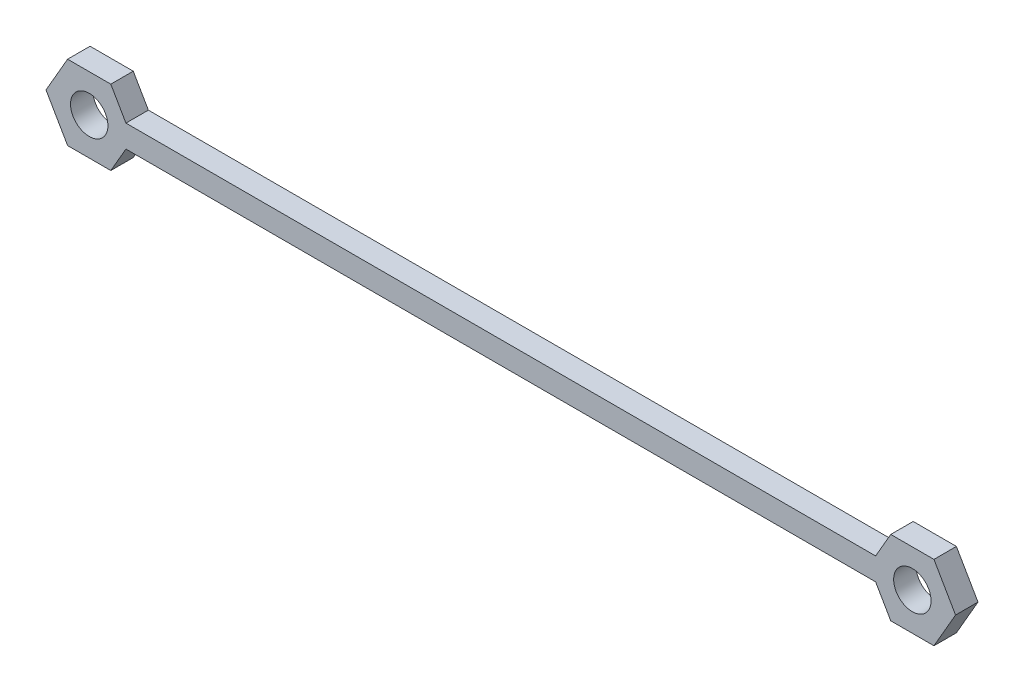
ISO-10303-21;
HEADER;
FILE_DESCRIPTION(('STEP AP214'),'2;1');
FILE_NAME('part.step','',(''),(''),'','','');
FILE_SCHEMA(('AUTOMOTIVE_DESIGN { 1 0 10303 214 1 1 1 1 }'));
ENDSEC;
DATA;
#1=APPLICATION_CONTEXT('core data for automotive mechanical design processes');
#2=APPLICATION_PROTOCOL_DEFINITION('international standard','automotive_design',2000,#1);
#3=PRODUCT_CONTEXT('',#1,'mechanical');
#4=PRODUCT('Part','Part','',(#3));
#5=PRODUCT_RELATED_PRODUCT_CATEGORY('part','',(#4));
#6=PRODUCT_DEFINITION_FORMATION('','',#4);
#7=PRODUCT_DEFINITION_CONTEXT('part definition',#1,'design');
#8=PRODUCT_DEFINITION('design','',#6,#7);
#9=PRODUCT_DEFINITION_SHAPE('','',#8);
#10=(LENGTH_UNIT() NAMED_UNIT(*) SI_UNIT(.MILLI.,.METRE.));
#11=(NAMED_UNIT(*) PLANE_ANGLE_UNIT() SI_UNIT($,.RADIAN.));
#12=(NAMED_UNIT(*) SI_UNIT($,.STERADIAN.) SOLID_ANGLE_UNIT());
#13=UNCERTAINTY_MEASURE_WITH_UNIT(LENGTH_MEASURE(1.E-05),#10,'distance_accuracy_value','');
#14=(GEOMETRIC_REPRESENTATION_CONTEXT(3) GLOBAL_UNCERTAINTY_ASSIGNED_CONTEXT((#13)) GLOBAL_UNIT_ASSIGNED_CONTEXT((#10,
#11,#12)) REPRESENTATION_CONTEXT('',''));
#15=CARTESIAN_POINT('',(0.,0.,0.));
#16=DIRECTION('',(0.,0.,1.));
#17=DIRECTION('',(1.,0.,0.));
#18=AXIS2_PLACEMENT_3D('',#15,#16,#17);
#19=CARTESIAN_POINT('',(0.,0.,1.5));
#20=DIRECTION('',(0.,0.,1.));
#21=DIRECTION('',(1.,0.,0.));
#22=AXIS2_PLACEMENT_3D('',#19,#20,#21);
#23=PLANE('',#22);
#24=CARTESIAN_POINT('',(-55.,0.,1.5));
#25=DIRECTION('',(0.,0.,1.));
#26=DIRECTION('',(1.,0.,0.));
#27=AXIS2_PLACEMENT_3D('',#24,#25,#26);
#28=CIRCLE('',#27,2.5);
#29=CARTESIAN_POINT('',(-52.5,0.,1.5));
#30=VERTEX_POINT('',#29);
#31=EDGE_CURVE('E175',#30,#30,#28,.T.);
#32=ORIENTED_EDGE('',*,*,#31,.F.);
#33=EDGE_LOOP('',(#32));
#34=FACE_BOUND('',#33,.T.);
#35=DIRECTION('',(-0.500000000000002,0.866025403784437,0.));
#36=VECTOR('',#35,1.);
#37=CARTESIAN_POINT('',(-52.1132486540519,5.,1.5));
#38=LINE('',#37,#36);
#39=CARTESIAN_POINT('',(-50.0925227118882,1.5,1.5));
#40=VERTEX_POINT('',#39);
#41=CARTESIAN_POINT('',(-52.1132486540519,5.,1.5));
#42=VERTEX_POINT('',#41);
#43=EDGE_CURVE('E198',#40,#42,#38,.T.);
#44=ORIENTED_EDGE('',*,*,#43,.T.);
#45=DIRECTION('',(-1.,0.,0.));
#46=VECTOR('',#45,1.);
#47=CARTESIAN_POINT('',(-52.1132486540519,5.,1.5));
#48=LINE('',#47,#46);
#49=CARTESIAN_POINT('',(-57.8867513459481,4.99999999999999,1.5));
#50=VERTEX_POINT('',#49);
#51=EDGE_CURVE('E116',#42,#50,#48,.T.);
#52=ORIENTED_EDGE('',*,*,#51,.T.);
#53=DIRECTION('',(-0.499999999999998,-0.866025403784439,0.));
#54=VECTOR('',#53,1.);
#55=CARTESIAN_POINT('',(-57.8867513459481,4.99999999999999,1.5));
#56=LINE('',#55,#54);
#57=CARTESIAN_POINT('',(-60.7735026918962,0.,1.5));
#58=VERTEX_POINT('',#57);
#59=EDGE_CURVE('E231',#50,#58,#56,.T.);
#60=ORIENTED_EDGE('',*,*,#59,.T.);
#61=DIRECTION('',(0.500000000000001,-0.866025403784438,0.));
#62=VECTOR('',#61,1.);
#63=CARTESIAN_POINT('',(-60.7735026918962,0.,1.5));
#64=LINE('',#63,#62);
#65=CARTESIAN_POINT('',(-57.8867513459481,-5.,1.5));
#66=VERTEX_POINT('',#65);
#67=EDGE_CURVE('E250',#58,#66,#64,.T.);
#68=ORIENTED_EDGE('',*,*,#67,.T.);
#69=DIRECTION('',(1.,0.,0.));
#70=VECTOR('',#69,1.);
#71=CARTESIAN_POINT('',(-57.8867513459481,-5.,1.5));
#72=LINE('',#71,#70);
#73=CARTESIAN_POINT('',(-52.1132486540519,-4.99999999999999,1.5));
#74=VERTEX_POINT('',#73);
#75=EDGE_CURVE('E247',#66,#74,#72,.T.);
#76=ORIENTED_EDGE('',*,*,#75,.T.);
#77=DIRECTION('',(0.499999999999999,0.866025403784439,0.));
#78=VECTOR('',#77,1.);
#79=CARTESIAN_POINT('',(-50.0925227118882,-1.5,1.5));
#80=LINE('',#79,#78);
#81=CARTESIAN_POINT('',(-50.0925227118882,-1.5,1.5));
#82=VERTEX_POINT('',#81);
#83=EDGE_CURVE('E249',#74,#82,#80,.T.);
#84=ORIENTED_EDGE('',*,*,#83,.T.);
#85=DIRECTION('',(1.,0.,0.));
#86=VECTOR('',#85,1.);
#87=CARTESIAN_POINT('',(-50.0925227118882,-1.5,1.5));
#88=LINE('',#87,#86);
#89=CARTESIAN_POINT('',(50.0925227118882,-1.5,1.5));
#90=VERTEX_POINT('',#89);
#91=EDGE_CURVE('E252',#82,#90,#88,.T.);
#92=ORIENTED_EDGE('',*,*,#91,.T.);
#93=DIRECTION('',(0.499999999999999,-0.866025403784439,0.));
#94=VECTOR('',#93,1.);
#95=CARTESIAN_POINT('',(50.0925227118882,-1.5,1.5));
#96=LINE('',#95,#94);
#97=CARTESIAN_POINT('',(52.1132486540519,-4.99999999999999,1.5));
#98=VERTEX_POINT('',#97);
#99=EDGE_CURVE('E258',#90,#98,#96,.T.);
#100=ORIENTED_EDGE('',*,*,#99,.T.);
#101=DIRECTION('',(1.,0.,0.));
#102=VECTOR('',#101,1.);
#103=CARTESIAN_POINT('',(57.8867513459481,-5.,1.5));
#104=LINE('',#103,#102);
#105=CARTESIAN_POINT('',(57.8867513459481,-5.,1.5));
#106=VERTEX_POINT('',#105);
#107=EDGE_CURVE('E260',#98,#106,#104,.T.);
#108=ORIENTED_EDGE('',*,*,#107,.T.);
#109=DIRECTION('',(0.500000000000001,0.866025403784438,0.));
#110=VECTOR('',#109,1.);
#111=CARTESIAN_POINT('',(60.7735026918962,0.,1.5));
#112=LINE('',#111,#110);
#113=CARTESIAN_POINT('',(60.7735026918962,0.,1.5));
#114=VERTEX_POINT('',#113);
#115=EDGE_CURVE('E262',#106,#114,#112,.T.);
#116=ORIENTED_EDGE('',*,*,#115,.T.);
#117=DIRECTION('',(-0.499999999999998,0.866025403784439,0.));
#118=VECTOR('',#117,1.);
#119=CARTESIAN_POINT('',(57.8867513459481,4.99999999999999,1.5));
#120=LINE('',#119,#118);
#121=CARTESIAN_POINT('',(57.8867513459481,4.99999999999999,1.5));
#122=VERTEX_POINT('',#121);
#123=EDGE_CURVE('E153',#114,#122,#120,.T.);
#124=ORIENTED_EDGE('',*,*,#123,.T.);
#125=DIRECTION('',(-1.,0.,0.));
#126=VECTOR('',#125,1.);
#127=CARTESIAN_POINT('',(52.1132486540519,5.,1.5));
#128=LINE('',#127,#126);
#129=CARTESIAN_POINT('',(52.1132486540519,5.,1.5));
#130=VERTEX_POINT('',#129);
#131=EDGE_CURVE('E147',#122,#130,#128,.T.);
#132=ORIENTED_EDGE('',*,*,#131,.T.);
#133=DIRECTION('',(-0.500000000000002,-0.866025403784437,0.));
#134=VECTOR('',#133,1.);
#135=CARTESIAN_POINT('',(52.1132486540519,5.,1.5));
#136=LINE('',#135,#134);
#137=CARTESIAN_POINT('',(50.0925227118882,1.5,1.5));
#138=VERTEX_POINT('',#137);
#139=EDGE_CURVE('E151',#130,#138,#136,.T.);
#140=ORIENTED_EDGE('',*,*,#139,.T.);
#141=DIRECTION('',(-1.,0.,0.));
#142=VECTOR('',#141,1.);
#143=CARTESIAN_POINT('',(-50.0925227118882,1.5,1.5));
#144=LINE('',#143,#142);
#145=EDGE_CURVE('E55',#138,#40,#144,.T.);
#146=ORIENTED_EDGE('',*,*,#145,.T.);
#147=EDGE_LOOP('',(#44,#52,#60,#68,#76,#84,#92,#100,#108,#116,#124,#132,#140,#146));
#148=FACE_BOUND('',#147,.T.);
#149=CARTESIAN_POINT('',(55.,0.,1.5));
#150=DIRECTION('',(0.,0.,1.));
#151=DIRECTION('',(1.,0.,0.));
#152=AXIS2_PLACEMENT_3D('',#149,#150,#151);
#153=CIRCLE('',#152,2.5);
#154=CARTESIAN_POINT('',(57.5,0.,1.5));
#155=VERTEX_POINT('',#154);
#156=EDGE_CURVE('E304',#155,#155,#153,.T.);
#157=ORIENTED_EDGE('',*,*,#156,.F.);
#158=EDGE_LOOP('',(#157));
#159=FACE_BOUND('',#158,.T.);
#160=ADVANCED_FACE('F38',(#34,#148,#159),#23,.T.);
#161=CARTESIAN_POINT('',(0.,0.,-1.5));
#162=DIRECTION('',(0.,0.,1.));
#163=DIRECTION('',(1.,0.,0.));
#164=AXIS2_PLACEMENT_3D('',#161,#162,#163);
#165=PLANE('',#164);
#166=DIRECTION('',(-0.500000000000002,0.866025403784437,0.));
#167=VECTOR('',#166,1.);
#168=CARTESIAN_POINT('',(-52.1132486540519,5.,-1.5));
#169=LINE('',#168,#167);
#170=CARTESIAN_POINT('',(-50.0925227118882,1.5,-1.5));
#171=VERTEX_POINT('',#170);
#172=CARTESIAN_POINT('',(-52.1132486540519,5.,-1.5));
#173=VERTEX_POINT('',#172);
#174=EDGE_CURVE('E171',#171,#173,#169,.T.);
#175=ORIENTED_EDGE('',*,*,#174,.F.);
#176=DIRECTION('',(-1.,0.,0.));
#177=VECTOR('',#176,1.);
#178=CARTESIAN_POINT('',(-50.0925227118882,1.5,-1.5));
#179=LINE('',#178,#177);
#180=CARTESIAN_POINT('',(50.0925227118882,1.5,-1.5));
#181=VERTEX_POINT('',#180);
#182=EDGE_CURVE('E108',#181,#171,#179,.T.);
#183=ORIENTED_EDGE('',*,*,#182,.F.);
#184=DIRECTION('',(-0.500000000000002,-0.866025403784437,0.));
#185=VECTOR('',#184,1.);
#186=CARTESIAN_POINT('',(52.1132486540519,5.,-1.5));
#187=LINE('',#186,#185);
#188=CARTESIAN_POINT('',(52.1132486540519,5.,-1.5));
#189=VERTEX_POINT('',#188);
#190=EDGE_CURVE('E102',#189,#181,#187,.T.);
#191=ORIENTED_EDGE('',*,*,#190,.F.);
#192=DIRECTION('',(-1.,0.,0.));
#193=VECTOR('',#192,1.);
#194=CARTESIAN_POINT('',(52.1132486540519,5.,-1.5));
#195=LINE('',#194,#193);
#196=CARTESIAN_POINT('',(57.8867513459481,4.99999999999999,-1.5));
#197=VERTEX_POINT('',#196);
#198=EDGE_CURVE('E161',#197,#189,#195,.T.);
#199=ORIENTED_EDGE('',*,*,#198,.F.);
#200=DIRECTION('',(-0.499999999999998,0.866025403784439,0.));
#201=VECTOR('',#200,1.);
#202=CARTESIAN_POINT('',(57.8867513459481,4.99999999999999,-1.5));
#203=LINE('',#202,#201);
#204=CARTESIAN_POINT('',(60.7735026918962,0.,-1.5));
#205=VERTEX_POINT('',#204);
#206=EDGE_CURVE('E193',#205,#197,#203,.T.);
#207=ORIENTED_EDGE('',*,*,#206,.F.);
#208=DIRECTION('',(0.500000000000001,0.866025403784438,0.));
#209=VECTOR('',#208,1.);
#210=CARTESIAN_POINT('',(60.7735026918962,0.,-1.5));
#211=LINE('',#210,#209);
#212=CARTESIAN_POINT('',(57.8867513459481,-5.,-1.5));
#213=VERTEX_POINT('',#212);
#214=EDGE_CURVE('E191',#213,#205,#211,.T.);
#215=ORIENTED_EDGE('',*,*,#214,.F.);
#216=DIRECTION('',(1.,0.,0.));
#217=VECTOR('',#216,1.);
#218=CARTESIAN_POINT('',(57.8867513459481,-5.,-1.5));
#219=LINE('',#218,#217);
#220=CARTESIAN_POINT('',(52.1132486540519,-4.99999999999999,-1.5));
#221=VERTEX_POINT('',#220);
#222=EDGE_CURVE('E189',#221,#213,#219,.T.);
#223=ORIENTED_EDGE('',*,*,#222,.F.);
#224=DIRECTION('',(0.499999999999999,-0.866025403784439,0.));
#225=VECTOR('',#224,1.);
#226=CARTESIAN_POINT('',(50.0925227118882,-1.5,-1.5));
#227=LINE('',#226,#225);
#228=CARTESIAN_POINT('',(50.0925227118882,-1.5,-1.5));
#229=VERTEX_POINT('',#228);
#230=EDGE_CURVE('E187',#229,#221,#227,.T.);
#231=ORIENTED_EDGE('',*,*,#230,.F.);
#232=DIRECTION('',(1.,0.,0.));
#233=VECTOR('',#232,1.);
#234=CARTESIAN_POINT('',(-50.0925227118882,-1.5,-1.5));
#235=LINE('',#234,#233);
#236=CARTESIAN_POINT('',(-50.0925227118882,-1.5,-1.5));
#237=VERTEX_POINT('',#236);
#238=EDGE_CURVE('E185',#237,#229,#235,.T.);
#239=ORIENTED_EDGE('',*,*,#238,.F.);
#240=DIRECTION('',(0.499999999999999,0.866025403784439,0.));
#241=VECTOR('',#240,1.);
#242=CARTESIAN_POINT('',(-50.0925227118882,-1.5,-1.5));
#243=LINE('',#242,#241);
#244=CARTESIAN_POINT('',(-52.1132486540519,-4.99999999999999,-1.5));
#245=VERTEX_POINT('',#244);
#246=EDGE_CURVE('E183',#245,#237,#243,.T.);
#247=ORIENTED_EDGE('',*,*,#246,.F.);
#248=DIRECTION('',(1.,0.,0.));
#249=VECTOR('',#248,1.);
#250=CARTESIAN_POINT('',(-57.8867513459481,-5.,-1.5));
#251=LINE('',#250,#249);
#252=CARTESIAN_POINT('',(-57.8867513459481,-5.,-1.5));
#253=VERTEX_POINT('',#252);
#254=EDGE_CURVE('E181',#253,#245,#251,.T.);
#255=ORIENTED_EDGE('',*,*,#254,.F.);
#256=DIRECTION('',(0.500000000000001,-0.866025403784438,0.));
#257=VECTOR('',#256,1.);
#258=CARTESIAN_POINT('',(-60.7735026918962,0.,-1.5));
#259=LINE('',#258,#257);
#260=CARTESIAN_POINT('',(-60.7735026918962,0.,-1.5));
#261=VERTEX_POINT('',#260);
#262=EDGE_CURVE('E179',#261,#253,#259,.T.);
#263=ORIENTED_EDGE('',*,*,#262,.F.);
#264=DIRECTION('',(-0.499999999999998,-0.866025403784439,0.));
#265=VECTOR('',#264,1.);
#266=CARTESIAN_POINT('',(-57.8867513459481,4.99999999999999,-1.5));
#267=LINE('',#266,#265);
#268=CARTESIAN_POINT('',(-57.8867513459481,4.99999999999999,-1.5));
#269=VERTEX_POINT('',#268);
#270=EDGE_CURVE('E177',#269,#261,#267,.T.);
#271=ORIENTED_EDGE('',*,*,#270,.F.);
#272=DIRECTION('',(-1.,0.,0.));
#273=VECTOR('',#272,1.);
#274=CARTESIAN_POINT('',(-52.1132486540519,5.,-1.5));
#275=LINE('',#274,#273);
#276=EDGE_CURVE('E174',#173,#269,#275,.T.);
#277=ORIENTED_EDGE('',*,*,#276,.F.);
#278=EDGE_LOOP('',(#175,#183,#191,#199,#207,#215,#223,#231,#239,#247,#255,#263,#271,#277));
#279=FACE_BOUND('',#278,.T.);
#280=CARTESIAN_POINT('',(-55.,0.,-1.5));
#281=DIRECTION('',(0.,0.,1.));
#282=DIRECTION('',(1.,0.,0.));
#283=AXIS2_PLACEMENT_3D('',#280,#281,#282);
#284=CIRCLE('',#283,2.5);
#285=CARTESIAN_POINT('',(-52.5,0.,-1.5));
#286=VERTEX_POINT('',#285);
#287=EDGE_CURVE('E310',#286,#286,#284,.T.);
#288=ORIENTED_EDGE('',*,*,#287,.T.);
#289=EDGE_LOOP('',(#288));
#290=FACE_BOUND('',#289,.T.);
#291=CARTESIAN_POINT('',(55.,0.,-1.5));
#292=DIRECTION('',(0.,0.,1.));
#293=DIRECTION('',(1.,0.,0.));
#294=AXIS2_PLACEMENT_3D('',#291,#292,#293);
#295=CIRCLE('',#294,2.5);
#296=CARTESIAN_POINT('',(57.5,0.,-1.5));
#297=VERTEX_POINT('',#296);
#298=EDGE_CURVE('E307',#297,#297,#295,.T.);
#299=ORIENTED_EDGE('',*,*,#298,.T.);
#300=EDGE_LOOP('',(#299));
#301=FACE_BOUND('',#300,.T.);
#302=ADVANCED_FACE('F235',(#279,#290,#301),#165,.F.);
#303=CARTESIAN_POINT('',(-52.1132486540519,5.,1.5));
#304=DIRECTION('',(-0.866025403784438,-0.500000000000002,0.));
#305=DIRECTION('',(0.500000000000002,-0.866025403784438,0.));
#306=AXIS2_PLACEMENT_3D('',#303,#304,#305);
#307=PLANE('',#306);
#308=ORIENTED_EDGE('',*,*,#174,.T.);
#309=DIRECTION('',(0.,0.,-1.));
#310=VECTOR('',#309,1.);
#311=CARTESIAN_POINT('',(-52.1132486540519,5.,1.5));
#312=LINE('',#311,#310);
#313=EDGE_CURVE('E11',#42,#173,#312,.T.);
#314=ORIENTED_EDGE('',*,*,#313,.F.);
#315=ORIENTED_EDGE('',*,*,#43,.F.);
#316=DIRECTION('',(0.,0.,-1.));
#317=VECTOR('',#316,1.);
#318=CARTESIAN_POINT('',(-50.0925227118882,1.5,1.5));
#319=LINE('',#318,#317);
#320=EDGE_CURVE('E167',#40,#171,#319,.T.);
#321=ORIENTED_EDGE('',*,*,#320,.T.);
#322=EDGE_LOOP('',(#308,#314,#315,#321));
#323=FACE_BOUND('',#322,.T.);
#324=ADVANCED_FACE('F40',(#323),#307,.F.);
#325=CARTESIAN_POINT('',(-52.1132486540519,5.,1.5));
#326=DIRECTION('',(0.,-1.,0.));
#327=DIRECTION('',(1.,0.,0.));
#328=AXIS2_PLACEMENT_3D('',#325,#326,#327);
#329=PLANE('',#328);
#330=ORIENTED_EDGE('',*,*,#276,.T.);
#331=DIRECTION('',(0.,0.,-1.));
#332=VECTOR('',#331,1.);
#333=CARTESIAN_POINT('',(-57.8867513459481,4.99999999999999,1.5));
#334=LINE('',#333,#332);
#335=EDGE_CURVE('E47',#50,#269,#334,.T.);
#336=ORIENTED_EDGE('',*,*,#335,.F.);
#337=ORIENTED_EDGE('',*,*,#51,.F.);
#338=ORIENTED_EDGE('',*,*,#313,.T.);
#339=EDGE_LOOP('',(#330,#336,#337,#338));
#340=FACE_BOUND('',#339,.T.);
#341=ADVANCED_FACE('F435',(#340),#329,.F.);
#342=CARTESIAN_POINT('',(-57.8867513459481,4.99999999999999,1.5));
#343=DIRECTION('',(0.86602540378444,-0.499999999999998,0.));
#344=DIRECTION('',(0.499999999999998,0.86602540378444,0.));
#345=AXIS2_PLACEMENT_3D('',#342,#343,#344);
#346=PLANE('',#345);
#347=ORIENTED_EDGE('',*,*,#270,.T.);
#348=DIRECTION('',(0.,0.,-1.));
#349=VECTOR('',#348,1.);
#350=CARTESIAN_POINT('',(-60.7735026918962,0.,1.5));
#351=LINE('',#350,#349);
#352=EDGE_CURVE('E223',#58,#261,#351,.T.);
#353=ORIENTED_EDGE('',*,*,#352,.F.);
#354=ORIENTED_EDGE('',*,*,#59,.F.);
#355=ORIENTED_EDGE('',*,*,#335,.T.);
#356=EDGE_LOOP('',(#347,#353,#354,#355));
#357=FACE_BOUND('',#356,.T.);
#358=ADVANCED_FACE('F229',(#357),#346,.F.);
#359=CARTESIAN_POINT('',(-60.7735026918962,0.,1.5));
#360=DIRECTION('',(0.866025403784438,0.500000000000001,0.));
#361=DIRECTION('',(-0.500000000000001,0.866025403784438,0.));
#362=AXIS2_PLACEMENT_3D('',#359,#360,#361);
#363=PLANE('',#362);
#364=ORIENTED_EDGE('',*,*,#262,.T.);
#365=DIRECTION('',(0.,0.,-1.));
#366=VECTOR('',#365,1.);
#367=CARTESIAN_POINT('',(-57.8867513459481,-5.,1.5));
#368=LINE('',#367,#366);
#369=EDGE_CURVE('E220',#66,#253,#368,.T.);
#370=ORIENTED_EDGE('',*,*,#369,.F.);
#371=ORIENTED_EDGE('',*,*,#67,.F.);
#372=ORIENTED_EDGE('',*,*,#352,.T.);
#373=EDGE_LOOP('',(#364,#370,#371,#372));
#374=FACE_BOUND('',#373,.T.);
#375=ADVANCED_FACE('F241',(#374),#363,.F.);
#376=CARTESIAN_POINT('',(-57.8867513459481,-5.,1.5));
#377=DIRECTION('',(0.,1.,0.));
#378=DIRECTION('',(-1.,0.,0.));
#379=AXIS2_PLACEMENT_3D('',#376,#377,#378);
#380=PLANE('',#379);
#381=ORIENTED_EDGE('',*,*,#254,.T.);
#382=DIRECTION('',(0.,0.,-1.));
#383=VECTOR('',#382,1.);
#384=CARTESIAN_POINT('',(-52.1132486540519,-4.99999999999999,1.5));
#385=LINE('',#384,#383);
#386=EDGE_CURVE('E217',#74,#245,#385,.T.);
#387=ORIENTED_EDGE('',*,*,#386,.F.);
#388=ORIENTED_EDGE('',*,*,#75,.F.);
#389=ORIENTED_EDGE('',*,*,#369,.T.);
#390=EDGE_LOOP('',(#381,#387,#388,#389));
#391=FACE_BOUND('',#390,.T.);
#392=ADVANCED_FACE('F245',(#391),#380,.F.);
#393=CARTESIAN_POINT('',(-50.0925227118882,-1.5,1.5));
#394=DIRECTION('',(-0.866025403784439,0.499999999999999,0.));
#395=DIRECTION('',(-0.499999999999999,-0.866025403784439,0.));
#396=AXIS2_PLACEMENT_3D('',#393,#394,#395);
#397=PLANE('',#396);
#398=ORIENTED_EDGE('',*,*,#246,.T.);
#399=DIRECTION('',(0.,0.,-1.));
#400=VECTOR('',#399,1.);
#401=CARTESIAN_POINT('',(-50.0925227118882,-1.5,1.5));
#402=LINE('',#401,#400);
#403=EDGE_CURVE('E214',#82,#237,#402,.T.);
#404=ORIENTED_EDGE('',*,*,#403,.F.);
#405=ORIENTED_EDGE('',*,*,#83,.F.);
#406=ORIENTED_EDGE('',*,*,#386,.T.);
#407=EDGE_LOOP('',(#398,#404,#405,#406));
#408=FACE_BOUND('',#407,.T.);
#409=ADVANCED_FACE('F396',(#408),#397,.F.);
#410=CARTESIAN_POINT('',(-50.0925227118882,-1.5,1.5));
#411=DIRECTION('',(0.,1.,0.));
#412=DIRECTION('',(0.,0.,1.));
#413=AXIS2_PLACEMENT_3D('',#410,#411,#412);
#414=PLANE('',#413);
#415=ORIENTED_EDGE('',*,*,#238,.T.);
#416=DIRECTION('',(0.,0.,-1.));
#417=VECTOR('',#416,1.);
#418=CARTESIAN_POINT('',(50.0925227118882,-1.5,1.5));
#419=LINE('',#418,#417);
#420=EDGE_CURVE('E211',#90,#229,#419,.T.);
#421=ORIENTED_EDGE('',*,*,#420,.F.);
#422=ORIENTED_EDGE('',*,*,#91,.F.);
#423=ORIENTED_EDGE('',*,*,#403,.T.);
#424=EDGE_LOOP('',(#415,#421,#422,#423));
#425=FACE_BOUND('',#424,.T.);
#426=ADVANCED_FACE('F385',(#425),#414,.F.);
#427=CARTESIAN_POINT('',(50.0925227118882,-1.5,1.5));
#428=DIRECTION('',(0.866025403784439,0.499999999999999,0.));
#429=DIRECTION('',(-0.499999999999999,0.866025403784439,0.));
#430=AXIS2_PLACEMENT_3D('',#427,#428,#429);
#431=PLANE('',#430);
#432=ORIENTED_EDGE('',*,*,#230,.T.);
#433=DIRECTION('',(0.,0.,-1.));
#434=VECTOR('',#433,1.);
#435=CARTESIAN_POINT('',(52.1132486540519,-4.99999999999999,1.5));
#436=LINE('',#435,#434);
#437=EDGE_CURVE('E208',#98,#221,#436,.T.);
#438=ORIENTED_EDGE('',*,*,#437,.F.);
#439=ORIENTED_EDGE('',*,*,#99,.F.);
#440=ORIENTED_EDGE('',*,*,#420,.T.);
#441=EDGE_LOOP('',(#432,#438,#439,#440));
#442=FACE_BOUND('',#441,.T.);
#443=ADVANCED_FACE('F374',(#442),#431,.F.);
#444=CARTESIAN_POINT('',(57.8867513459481,-5.,1.5));
#445=DIRECTION('',(0.,1.,0.));
#446=DIRECTION('',(-1.,0.,0.));
#447=AXIS2_PLACEMENT_3D('',#444,#445,#446);
#448=PLANE('',#447);
#449=ORIENTED_EDGE('',*,*,#222,.T.);
#450=DIRECTION('',(0.,0.,-1.));
#451=VECTOR('',#450,1.);
#452=CARTESIAN_POINT('',(57.8867513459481,-5.,1.5));
#453=LINE('',#452,#451);
#454=EDGE_CURVE('E205',#106,#213,#453,.T.);
#455=ORIENTED_EDGE('',*,*,#454,.F.);
#456=ORIENTED_EDGE('',*,*,#107,.F.);
#457=ORIENTED_EDGE('',*,*,#437,.T.);
#458=EDGE_LOOP('',(#449,#455,#456,#457));
#459=FACE_BOUND('',#458,.T.);
#460=ADVANCED_FACE('F364',(#459),#448,.F.);
#461=CARTESIAN_POINT('',(60.7735026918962,0.,1.5));
#462=DIRECTION('',(-0.866025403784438,0.500000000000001,0.));
#463=DIRECTION('',(-0.500000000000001,-0.866025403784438,0.));
#464=AXIS2_PLACEMENT_3D('',#461,#462,#463);
#465=PLANE('',#464);
#466=ORIENTED_EDGE('',*,*,#214,.T.);
#467=DIRECTION('',(0.,0.,-1.));
#468=VECTOR('',#467,1.);
#469=CARTESIAN_POINT('',(60.7735026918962,0.,1.5));
#470=LINE('',#469,#468);
#471=EDGE_CURVE('E202',#114,#205,#470,.T.);
#472=ORIENTED_EDGE('',*,*,#471,.F.);
#473=ORIENTED_EDGE('',*,*,#115,.F.);
#474=ORIENTED_EDGE('',*,*,#454,.T.);
#475=EDGE_LOOP('',(#466,#472,#473,#474));
#476=FACE_BOUND('',#475,.T.);
#477=ADVANCED_FACE('F268',(#476),#465,.F.);
#478=CARTESIAN_POINT('',(57.8867513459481,4.99999999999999,1.5));
#479=DIRECTION('',(-0.86602540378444,-0.499999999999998,0.));
#480=DIRECTION('',(0.499999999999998,-0.86602540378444,0.));
#481=AXIS2_PLACEMENT_3D('',#478,#479,#480);
#482=PLANE('',#481);
#483=ORIENTED_EDGE('',*,*,#206,.T.);
#484=DIRECTION('',(0.,0.,-1.));
#485=VECTOR('',#484,1.);
#486=CARTESIAN_POINT('',(57.8867513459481,4.99999999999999,1.5));
#487=LINE('',#486,#485);
#488=EDGE_CURVE('E162',#122,#197,#487,.T.);
#489=ORIENTED_EDGE('',*,*,#488,.F.);
#490=ORIENTED_EDGE('',*,*,#123,.F.);
#491=ORIENTED_EDGE('',*,*,#471,.T.);
#492=EDGE_LOOP('',(#483,#489,#490,#491));
#493=FACE_BOUND('',#492,.T.);
#494=ADVANCED_FACE('F272',(#493),#482,.F.);
#495=CARTESIAN_POINT('',(52.1132486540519,5.,1.5));
#496=DIRECTION('',(0.,-1.,0.));
#497=DIRECTION('',(1.,0.,0.));
#498=AXIS2_PLACEMENT_3D('',#495,#496,#497);
#499=PLANE('',#498);
#500=ORIENTED_EDGE('',*,*,#198,.T.);
#501=DIRECTION('',(0.,0.,-1.));
#502=VECTOR('',#501,1.);
#503=CARTESIAN_POINT('',(52.1132486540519,5.,1.5));
#504=LINE('',#503,#502);
#505=EDGE_CURVE('E158',#130,#189,#504,.T.);
#506=ORIENTED_EDGE('',*,*,#505,.F.);
#507=ORIENTED_EDGE('',*,*,#131,.F.);
#508=ORIENTED_EDGE('',*,*,#488,.T.);
#509=EDGE_LOOP('',(#500,#506,#507,#508));
#510=FACE_BOUND('',#509,.T.);
#511=ADVANCED_FACE('F159',(#510),#499,.F.);
#512=CARTESIAN_POINT('',(52.1132486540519,5.,1.5));
#513=DIRECTION('',(0.866025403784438,-0.500000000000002,0.));
#514=DIRECTION('',(0.500000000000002,0.866025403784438,0.));
#515=AXIS2_PLACEMENT_3D('',#512,#513,#514);
#516=PLANE('',#515);
#517=ORIENTED_EDGE('',*,*,#190,.T.);
#518=DIRECTION('',(0.,0.,-1.));
#519=VECTOR('',#518,1.);
#520=CARTESIAN_POINT('',(50.0925227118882,1.5,1.5));
#521=LINE('',#520,#519);
#522=EDGE_CURVE('E163',#138,#181,#521,.T.);
#523=ORIENTED_EDGE('',*,*,#522,.F.);
#524=ORIENTED_EDGE('',*,*,#139,.F.);
#525=ORIENTED_EDGE('',*,*,#505,.T.);
#526=EDGE_LOOP('',(#517,#523,#524,#525));
#527=FACE_BOUND('',#526,.T.);
#528=ADVANCED_FACE('F165',(#527),#516,.F.);
#529=CARTESIAN_POINT('',(-50.0925227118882,1.5,1.5));
#530=DIRECTION('',(0.,-1.,0.));
#531=DIRECTION('',(0.,0.,-1.));
#532=AXIS2_PLACEMENT_3D('',#529,#530,#531);
#533=PLANE('',#532);
#534=ORIENTED_EDGE('',*,*,#182,.T.);
#535=ORIENTED_EDGE('',*,*,#320,.F.);
#536=ORIENTED_EDGE('',*,*,#145,.F.);
#537=ORIENTED_EDGE('',*,*,#522,.T.);
#538=EDGE_LOOP('',(#534,#535,#536,#537));
#539=FACE_BOUND('',#538,.T.);
#540=ADVANCED_FACE('F276',(#539),#533,.F.);
#541=CARTESIAN_POINT('',(-55.,0.,1.5));
#542=DIRECTION('',(0.,0.,-1.));
#543=DIRECTION('',(-1.,0.,0.));
#544=AXIS2_PLACEMENT_3D('',#541,#542,#543);
#545=CYLINDRICAL_SURFACE('',#544,2.5);
#546=ORIENTED_EDGE('',*,*,#31,.T.);
#547=EDGE_LOOP('',(#546));
#548=FACE_BOUND('',#547,.T.);
#549=ORIENTED_EDGE('',*,*,#287,.F.);
#550=EDGE_LOOP('',(#549));
#551=FACE_BOUND('',#550,.T.);
#552=ADVANCED_FACE('F278',(#548,#551),#545,.F.);
#553=CARTESIAN_POINT('',(55.,0.,1.5));
#554=DIRECTION('',(0.,0.,-1.));
#555=DIRECTION('',(-1.,0.,0.));
#556=AXIS2_PLACEMENT_3D('',#553,#554,#555);
#557=CYLINDRICAL_SURFACE('',#556,2.5);
#558=ORIENTED_EDGE('',*,*,#156,.T.);
#559=EDGE_LOOP('',(#558));
#560=FACE_BOUND('',#559,.T.);
#561=ORIENTED_EDGE('',*,*,#298,.F.);
#562=EDGE_LOOP('',(#561));
#563=FACE_BOUND('',#562,.T.);
#564=ADVANCED_FACE('F284',(#560,#563),#557,.F.);
#565=CLOSED_SHELL('',(#160,#302,#324,#341,#358,#375,#392,#409,#426,#443,#460,#477,#494,#511,
#528,#540,#552,#564));
#566=MANIFOLD_SOLID_BREP('B2',#565);
#567=ADVANCED_BREP_SHAPE_REPRESENTATION('',(#18,#566),#14);
#568=SHAPE_DEFINITION_REPRESENTATION(#9,#567);
ENDSEC;
END-ISO-10303-21;
